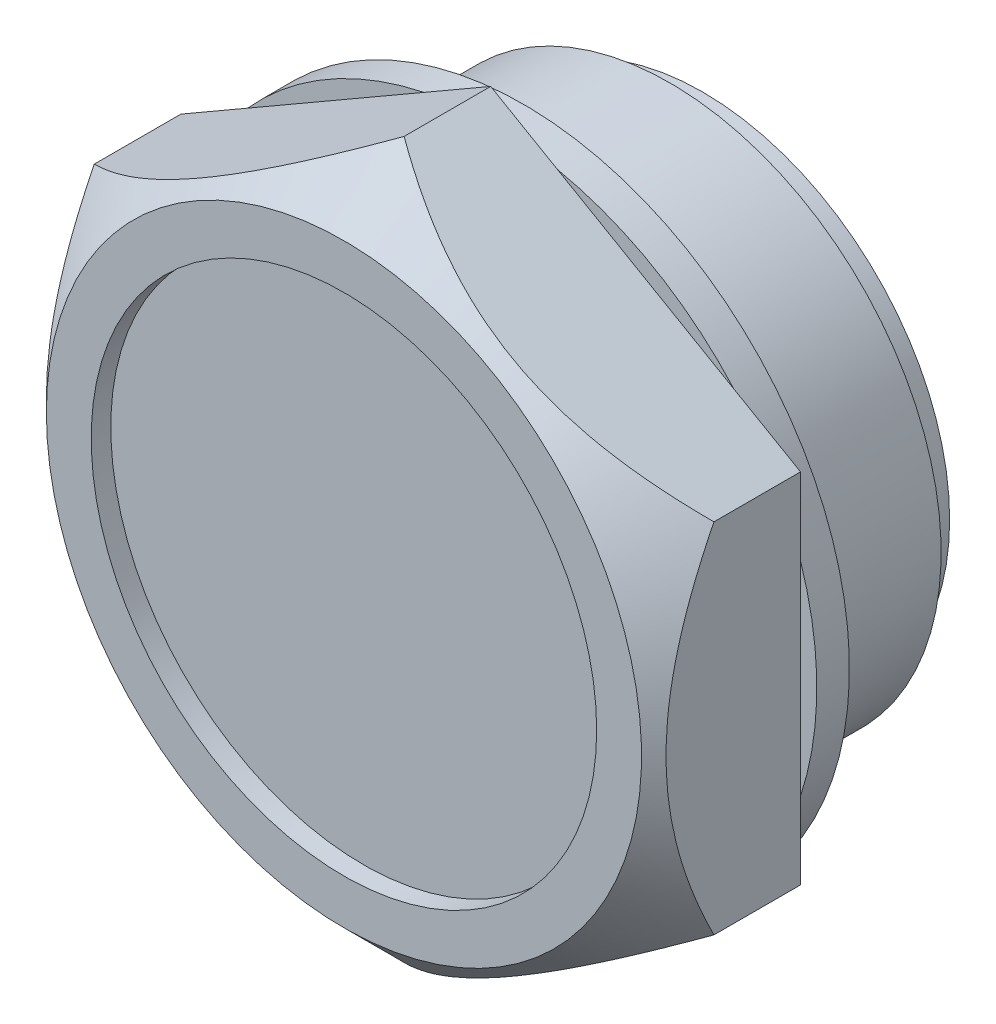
ISO-10303-21;
HEADER;
FILE_DESCRIPTION(('STEP AP214'),'2;1');
FILE_NAME('part.step','',(''),(''),'','','');
FILE_SCHEMA(('AUTOMOTIVE_DESIGN { 1 0 10303 214 1 1 1 1 }'));
ENDSEC;
DATA;
#1=APPLICATION_CONTEXT('core data for automotive mechanical design processes');
#2=APPLICATION_PROTOCOL_DEFINITION('international standard','automotive_design',2000,#1);
#3=PRODUCT_CONTEXT('',#1,'mechanical');
#4=PRODUCT('Part','Part','',(#3));
#5=PRODUCT_RELATED_PRODUCT_CATEGORY('part','',(#4));
#6=PRODUCT_DEFINITION_FORMATION('','',#4);
#7=PRODUCT_DEFINITION_CONTEXT('part definition',#1,'design');
#8=PRODUCT_DEFINITION('design','',#6,#7);
#9=PRODUCT_DEFINITION_SHAPE('','',#8);
#10=(LENGTH_UNIT() NAMED_UNIT(*) SI_UNIT(.MILLI.,.METRE.));
#11=(NAMED_UNIT(*) PLANE_ANGLE_UNIT() SI_UNIT($,.RADIAN.));
#12=(NAMED_UNIT(*) SI_UNIT($,.STERADIAN.) SOLID_ANGLE_UNIT());
#13=UNCERTAINTY_MEASURE_WITH_UNIT(LENGTH_MEASURE(1.E-05),#10,'distance_accuracy_value','');
#14=(GEOMETRIC_REPRESENTATION_CONTEXT(3) GLOBAL_UNCERTAINTY_ASSIGNED_CONTEXT((#13)) GLOBAL_UNIT_ASSIGNED_CONTEXT((#10,
#11,#12)) REPRESENTATION_CONTEXT('',''));
#15=CARTESIAN_POINT('',(0.,0.,0.));
#16=DIRECTION('',(0.,0.,1.));
#17=DIRECTION('',(1.,0.,0.));
#18=AXIS2_PLACEMENT_3D('',#15,#16,#17);
#19=CARTESIAN_POINT('',(0.,20.,2.));
#20=DIRECTION('',(0.,0.,-1.));
#21=DIRECTION('',(-1.,0.,0.));
#22=AXIS2_PLACEMENT_3D('',#19,#20,#21);
#23=PLANE('',#22);
#24=DIRECTION('',(-0.866025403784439,-0.5,0.));
#25=VECTOR('',#24,1.);
#26=CARTESIAN_POINT('',(19.0000000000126,-10.9696551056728,2.));
#27=LINE('',#26,#25);
#28=CARTESIAN_POINT('',(4.09167306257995,-19.5769816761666,2.));
#29=VERTEX_POINT('',#28);
#30=CARTESIAN_POINT('',(1.54832674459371E-08,-21.9393102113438,2.));
#31=VERTEX_POINT('',#30);
#32=EDGE_CURVE('E114',#29,#31,#27,.T.);
#33=ORIENTED_EDGE('',*,*,#32,.T.);
#34=DIRECTION('',(-0.866025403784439,0.5,0.));
#35=VECTOR('',#34,1.);
#36=CARTESIAN_POINT('',(1.54832674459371E-08,-21.9393102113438,2.));
#37=LINE('',#36,#35);
#38=CARTESIAN_POINT('',(-4.0916730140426,-19.576981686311,2.));
#39=VERTEX_POINT('',#38);
#40=EDGE_CURVE('E125',#31,#39,#37,.T.);
#41=ORIENTED_EDGE('',*,*,#40,.T.);
#42=CARTESIAN_POINT('',(0.,0.,2.));
#43=DIRECTION('',(0.,0.,-1.));
#44=DIRECTION('',(-1.,0.,0.));
#45=AXIS2_PLACEMENT_3D('',#42,#43,#44);
#46=CIRCLE('',#45,20.);
#47=EDGE_CURVE('E136',#29,#39,#46,.T.);
#48=ORIENTED_EDGE('',*,*,#47,.F.);
#49=EDGE_LOOP('',(#33,#41,#48));
#50=FACE_BOUND('',#49,.T.);
#51=ADVANCED_FACE('F15',(#50),#23,.T.);
#52=CARTESIAN_POINT('',(-14.9083269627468,-13.3319836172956,2.));
#53=VERTEX_POINT('',#52);
#54=CARTESIAN_POINT('',(-18.9999999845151,-10.9696550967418,2.));
#55=VERTEX_POINT('',#54);
#56=EDGE_CURVE('E135',#53,#55,#37,.T.);
#57=ORIENTED_EDGE('',*,*,#56,.T.);
#58=DIRECTION('',(0.,1.,0.));
#59=VECTOR('',#58,1.);
#60=CARTESIAN_POINT('',(-18.9999999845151,-10.9696550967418,2.));
#61=LINE('',#60,#59);
#62=CARTESIAN_POINT('',(-18.9999999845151,-6.24499804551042,2.));
#63=VERTEX_POINT('',#62);
#64=EDGE_CURVE('E164',#55,#63,#61,.T.);
#65=ORIENTED_EDGE('',*,*,#64,.T.);
#66=EDGE_CURVE('E209',#53,#63,#46,.T.);
#67=ORIENTED_EDGE('',*,*,#66,.F.);
#68=EDGE_LOOP('',(#57,#65,#67));
#69=FACE_BOUND('',#68,.T.);
#70=ADVANCED_FACE('F315',(#69),#23,.T.);
#71=CARTESIAN_POINT('',(-18.9999999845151,6.2449980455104,2.));
#72=VERTEX_POINT('',#71);
#73=CARTESIAN_POINT('',(-18.9999999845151,10.9696551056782,2.));
#74=VERTEX_POINT('',#73);
#75=EDGE_CURVE('E133',#72,#74,#61,.T.);
#76=ORIENTED_EDGE('',*,*,#75,.T.);
#77=DIRECTION('',(0.866025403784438,0.5,0.));
#78=VECTOR('',#77,1.);
#79=CARTESIAN_POINT('',(-18.9999999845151,10.9696551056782,2.));
#80=LINE('',#79,#78);
#81=CARTESIAN_POINT('',(-14.908326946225,13.331983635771,2.));
#82=VERTEX_POINT('',#81);
#83=EDGE_CURVE('E169',#74,#82,#80,.T.);
#84=ORIENTED_EDGE('',*,*,#83,.T.);
#85=EDGE_CURVE('E210',#72,#82,#46,.T.);
#86=ORIENTED_EDGE('',*,*,#85,.F.);
#87=EDGE_LOOP('',(#76,#84,#86));
#88=FACE_BOUND('',#87,.T.);
#89=ADVANCED_FACE('F320',(#88),#23,.T.);
#90=CARTESIAN_POINT('',(-4.09167303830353,19.5769816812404,2.));
#91=VERTEX_POINT('',#90);
#92=CARTESIAN_POINT('',(1.37390099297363E-12,21.9393102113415,2.));
#93=VERTEX_POINT('',#92);
#94=EDGE_CURVE('E167',#91,#93,#80,.T.);
#95=ORIENTED_EDGE('',*,*,#94,.T.);
#96=DIRECTION('',(0.866025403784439,-0.5,0.));
#97=VECTOR('',#96,1.);
#98=CARTESIAN_POINT('',(1.37390099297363E-12,21.9393102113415,2.));
#99=LINE('',#98,#97);
#100=CARTESIAN_POINT('',(4.09167303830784,19.5769816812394,2.));
#101=VERTEX_POINT('',#100);
#102=EDGE_CURVE('E175',#93,#101,#99,.T.);
#103=ORIENTED_EDGE('',*,*,#102,.T.);
#104=EDGE_CURVE('E215',#91,#101,#46,.T.);
#105=ORIENTED_EDGE('',*,*,#104,.F.);
#106=EDGE_LOOP('',(#95,#103,#105));
#107=FACE_BOUND('',#106,.T.);
#108=ADVANCED_FACE('F334',(#107),#23,.T.);
#109=CARTESIAN_POINT('',(19.0000000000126,-10.9696551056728,2.));
#110=VERTEX_POINT('',#109);
#111=CARTESIAN_POINT('',(14.9083269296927,-13.331983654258,2.));
#112=VERTEX_POINT('',#111);
#113=EDGE_CURVE('E142',#110,#112,#27,.T.);
#114=ORIENTED_EDGE('',*,*,#113,.T.);
#115=CARTESIAN_POINT('',(18.9999999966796,-6.24499800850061,2.));
#116=VERTEX_POINT('',#115);
#117=EDGE_CURVE('E599',#116,#112,#46,.T.);
#118=ORIENTED_EDGE('',*,*,#117,.F.);
#119=DIRECTION('',(7.05455941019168E-10,-1.,0.));
#120=VECTOR('',#119,1.);
#121=CARTESIAN_POINT('',(18.9999999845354,10.969655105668,2.));
#122=LINE('',#121,#120);
#123=EDGE_CURVE('E179',#116,#110,#122,.T.);
#124=ORIENTED_EDGE('',*,*,#123,.T.);
#125=EDGE_LOOP('',(#114,#118,#124));
#126=FACE_BOUND('',#125,.T.);
#127=ADVANCED_FACE('F325',(#126),#23,.T.);
#128=CARTESIAN_POINT('',(0.,0.,-11.));
#129=DIRECTION('',(0.,0.,-1.));
#130=DIRECTION('',(-1.,0.,0.));
#131=AXIS2_PLACEMENT_3D('',#128,#129,#130);
#132=PLANE('',#131);
#133=CARTESIAN_POINT('',(0.,0.,-11.));
#134=DIRECTION('',(0.,0.,-1.));
#135=DIRECTION('',(-1.,0.,0.));
#136=AXIS2_PLACEMENT_3D('',#133,#134,#135);
#137=CIRCLE('',#136,15.1455);
#138=CARTESIAN_POINT('',(-15.1455,0.,-11.));
#139=VERTEX_POINT('',#138);
#140=EDGE_CURVE('E231',#139,#139,#137,.T.);
#141=ORIENTED_EDGE('',*,*,#140,.T.);
#142=EDGE_LOOP('',(#141));
#143=FACE_BOUND('',#142,.T.);
#144=ADVANCED_FACE('F17',(#143),#132,.T.);
#145=CARTESIAN_POINT('',(0.,0.,-21.));
#146=DIRECTION('',(0.,0.,-1.));
#147=DIRECTION('',(-1.,0.,0.));
#148=AXIS2_PLACEMENT_3D('',#145,#146,#147);
#149=CYLINDRICAL_SURFACE('',#148,15.1455);
#150=ORIENTED_EDGE('',*,*,#140,.F.);
#151=EDGE_LOOP('',(#150));
#152=FACE_BOUND('',#151,.T.);
#153=CARTESIAN_POINT('',(0.,0.,-9.));
#154=DIRECTION('',(0.,0.,-1.));
#155=DIRECTION('',(-1.,0.,0.));
#156=AXIS2_PLACEMENT_3D('',#153,#154,#155);
#157=CIRCLE('',#156,15.1455);
#158=CARTESIAN_POINT('',(-15.1455,0.,-9.));
#159=VERTEX_POINT('',#158);
#160=EDGE_CURVE('E227',#159,#159,#157,.T.);
#161=ORIENTED_EDGE('',*,*,#160,.T.);
#162=EDGE_LOOP('',(#161));
#163=FACE_BOUND('',#162,.T.);
#164=ADVANCED_FACE('F340',(#152,#163),#149,.T.);
#165=CARTESIAN_POINT('',(0.,15.1455,-9.));
#166=DIRECTION('',(0.,0.,-1.));
#167=DIRECTION('',(-1.,0.,0.));
#168=AXIS2_PLACEMENT_3D('',#165,#166,#167);
#169=PLANE('',#168);
#170=CARTESIAN_POINT('',(0.,0.,-9.));
#171=DIRECTION('',(0.,0.,-1.));
#172=DIRECTION('',(-1.,0.,0.));
#173=AXIS2_PLACEMENT_3D('',#170,#171,#172);
#174=CIRCLE('',#173,16.6245);
#175=CARTESIAN_POINT('',(-16.6245,0.,-9.));
#176=VERTEX_POINT('',#175);
#177=EDGE_CURVE('E223',#176,#176,#174,.T.);
#178=ORIENTED_EDGE('',*,*,#177,.T.);
#179=EDGE_LOOP('',(#178));
#180=FACE_BOUND('',#179,.T.);
#181=ORIENTED_EDGE('',*,*,#160,.F.);
#182=EDGE_LOOP('',(#181));
#183=FACE_BOUND('',#182,.T.);
#184=ADVANCED_FACE('F537',(#180,#183),#169,.T.);
#185=CARTESIAN_POINT('',(0.,0.,-21.));
#186=DIRECTION('',(0.,0.,-1.));
#187=DIRECTION('',(-1.,0.,0.));
#188=AXIS2_PLACEMENT_3D('',#185,#186,#187);
#189=CYLINDRICAL_SURFACE('',#188,16.6245);
#190=ORIENTED_EDGE('',*,*,#177,.F.);
#191=EDGE_LOOP('',(#190));
#192=FACE_BOUND('',#191,.T.);
#193=CARTESIAN_POINT('',(0.,0.,0.));
#194=DIRECTION('',(0.,0.,-1.));
#195=DIRECTION('',(-1.,0.,0.));
#196=AXIS2_PLACEMENT_3D('',#193,#194,#195);
#197=CIRCLE('',#196,16.6245);
#198=CARTESIAN_POINT('',(-16.6245,0.,0.));
#199=VERTEX_POINT('',#198);
#200=EDGE_CURVE('E219',#199,#199,#197,.T.);
#201=ORIENTED_EDGE('',*,*,#200,.T.);
#202=EDGE_LOOP('',(#201));
#203=FACE_BOUND('',#202,.T.);
#204=ADVANCED_FACE('F529',(#192,#203),#189,.T.);
#205=CARTESIAN_POINT('',(0.,16.6245,0.));
#206=DIRECTION('',(0.,0.,-1.));
#207=DIRECTION('',(-1.,0.,0.));
#208=AXIS2_PLACEMENT_3D('',#205,#206,#207);
#209=PLANE('',#208);
#210=CARTESIAN_POINT('',(0.,0.,0.));
#211=DIRECTION('',(0.,0.,-1.));
#212=DIRECTION('',(-1.,0.,0.));
#213=AXIS2_PLACEMENT_3D('',#210,#211,#212);
#214=CIRCLE('',#213,20.);
#215=CARTESIAN_POINT('',(-20.,0.,0.));
#216=VERTEX_POINT('',#215);
#217=EDGE_CURVE('E214',#216,#216,#214,.T.);
#218=ORIENTED_EDGE('',*,*,#217,.T.);
#219=EDGE_LOOP('',(#218));
#220=FACE_BOUND('',#219,.T.);
#221=ORIENTED_EDGE('',*,*,#200,.F.);
#222=EDGE_LOOP('',(#221));
#223=FACE_BOUND('',#222,.T.);
#224=ADVANCED_FACE('F330',(#220,#223),#209,.T.);
#225=CARTESIAN_POINT('',(0.,0.,-21.));
#226=DIRECTION('',(0.,0.,-1.));
#227=DIRECTION('',(-1.,0.,0.));
#228=AXIS2_PLACEMENT_3D('',#225,#226,#227);
#229=CYLINDRICAL_SURFACE('',#228,20.);
#230=ORIENTED_EDGE('',*,*,#85,.T.);
#231=CARTESIAN_POINT('',(0.,0.,2.));
#232=DIRECTION('',(0.,0.,-1.));
#233=DIRECTION('',(-1.,0.,0.));
#234=AXIS2_PLACEMENT_3D('',#231,#232,#233);
#235=CIRCLE('',#234,20.);
#236=EDGE_CURVE('E203',#91,#82,#235,.F.);
#237=ORIENTED_EDGE('',*,*,#236,.F.);
#238=ORIENTED_EDGE('',*,*,#104,.T.);
#239=CARTESIAN_POINT('',(14.908326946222,13.3319836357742,2.));
#240=VERTEX_POINT('',#239);
#241=EDGE_CURVE('E378',#240,#101,#235,.F.);
#242=ORIENTED_EDGE('',*,*,#241,.F.);
#243=CARTESIAN_POINT('',(18.9999999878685,6.24499803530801,2.));
#244=VERTEX_POINT('',#243);
#245=EDGE_CURVE('E395',#240,#244,#46,.T.);
#246=ORIENTED_EDGE('',*,*,#245,.T.);
#247=EDGE_CURVE('E375',#116,#244,#235,.F.);
#248=ORIENTED_EDGE('',*,*,#247,.F.);
#249=ORIENTED_EDGE('',*,*,#117,.T.);
#250=EDGE_CURVE('E373',#29,#112,#235,.F.);
#251=ORIENTED_EDGE('',*,*,#250,.F.);
#252=ORIENTED_EDGE('',*,*,#47,.T.);
#253=EDGE_CURVE('E204',#53,#39,#235,.F.);
#254=ORIENTED_EDGE('',*,*,#253,.F.);
#255=ORIENTED_EDGE('',*,*,#66,.T.);
#256=EDGE_CURVE('E120',#72,#63,#235,.F.);
#257=ORIENTED_EDGE('',*,*,#256,.F.);
#258=EDGE_LOOP('',(#230,#237,#238,#242,#246,#248,#249,#251,#252,#254,#255,#257));
#259=FACE_BOUND('',#258,.T.);
#260=ORIENTED_EDGE('',*,*,#217,.F.);
#261=EDGE_LOOP('',(#260));
#262=FACE_BOUND('',#261,.T.);
#263=ADVANCED_FACE('F323',(#259,#262),#229,.T.);
#264=CARTESIAN_POINT('',(18.9999999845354,10.969655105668,2.));
#265=VERTEX_POINT('',#264);
#266=EDGE_CURVE('E173',#240,#265,#99,.T.);
#267=ORIENTED_EDGE('',*,*,#266,.T.);
#268=EDGE_CURVE('E181',#265,#244,#122,.T.);
#269=ORIENTED_EDGE('',*,*,#268,.T.);
#270=ORIENTED_EDGE('',*,*,#245,.F.);
#271=EDGE_LOOP('',(#267,#269,#270));
#272=FACE_BOUND('',#271,.T.);
#273=ADVANCED_FACE('F300',(#272),#23,.T.);
#274=CARTESIAN_POINT('',(-30.,-30.,2.));
#275=DIRECTION('',(0.,0.,-1.));
#276=DIRECTION('',(-1.,0.,0.));
#277=AXIS2_PLACEMENT_3D('',#274,#275,#276);
#278=PLANE('',#277);
#279=ORIENTED_EDGE('',*,*,#236,.T.);
#280=EDGE_CURVE('E174',#82,#91,#80,.T.);
#281=ORIENTED_EDGE('',*,*,#280,.T.);
#282=EDGE_LOOP('',(#279,#281));
#283=FACE_BOUND('',#282,.T.);
#284=ADVANCED_FACE('F297',(#283),#278,.F.);
#285=ORIENTED_EDGE('',*,*,#241,.T.);
#286=EDGE_CURVE('E180',#101,#240,#99,.T.);
#287=ORIENTED_EDGE('',*,*,#286,.T.);
#288=EDGE_LOOP('',(#285,#287));
#289=FACE_BOUND('',#288,.T.);
#290=ADVANCED_FACE('F299',(#289),#278,.F.);
#291=ORIENTED_EDGE('',*,*,#247,.T.);
#292=EDGE_CURVE('E37',#244,#116,#122,.T.);
#293=ORIENTED_EDGE('',*,*,#292,.T.);
#294=EDGE_LOOP('',(#291,#293));
#295=FACE_BOUND('',#294,.T.);
#296=ADVANCED_FACE('F397',(#295),#278,.F.);
#297=ORIENTED_EDGE('',*,*,#250,.T.);
#298=EDGE_CURVE('E139',#112,#29,#27,.T.);
#299=ORIENTED_EDGE('',*,*,#298,.T.);
#300=EDGE_LOOP('',(#297,#299));
#301=FACE_BOUND('',#300,.T.);
#302=ADVANCED_FACE('F402',(#301),#278,.F.);
#303=ORIENTED_EDGE('',*,*,#253,.T.);
#304=EDGE_CURVE('E128',#39,#53,#37,.T.);
#305=ORIENTED_EDGE('',*,*,#304,.T.);
#306=EDGE_LOOP('',(#303,#305));
#307=FACE_BOUND('',#306,.T.);
#308=ADVANCED_FACE('F407',(#307),#278,.F.);
#309=ORIENTED_EDGE('',*,*,#256,.T.);
#310=EDGE_CURVE('E168',#63,#72,#61,.T.);
#311=ORIENTED_EDGE('',*,*,#310,.T.);
#312=EDGE_LOOP('',(#309,#311));
#313=FACE_BOUND('',#312,.T.);
#314=ADVANCED_FACE('F302',(#313),#278,.F.);
#315=CARTESIAN_POINT('',(19.0000000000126,-10.9696551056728,2.));
#316=DIRECTION('',(-0.5,0.866025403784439,0.));
#317=DIRECTION('',(0.866025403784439,0.5,0.));
#318=AXIS2_PLACEMENT_3D('',#315,#316,#317);
#319=PLANE('',#318);
#320=DIRECTION('',(0.,0.,1.));
#321=VECTOR('',#320,1.);
#322=CARTESIAN_POINT('',(1.54832674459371E-08,-21.9393102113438,2.));
#323=LINE('',#322,#321);
#324=CARTESIAN_POINT('',(1.54832674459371E-08,-21.9393102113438,7.31068977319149));
#325=VERTEX_POINT('',#324);
#326=EDGE_CURVE('E109',#31,#325,#323,.T.);
#327=ORIENTED_EDGE('',*,*,#326,.F.);
#328=ORIENTED_EDGE('',*,*,#32,.F.);
#329=ORIENTED_EDGE('',*,*,#298,.F.);
#330=ORIENTED_EDGE('',*,*,#113,.F.);
#331=DIRECTION('',(0.,0.,1.));
#332=VECTOR('',#331,1.);
#333=CARTESIAN_POINT('',(19.0000000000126,-10.9696551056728,2.));
#334=LINE('',#333,#332);
#335=CARTESIAN_POINT('',(19.0000000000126,-10.9696551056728,7.3106897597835));
#336=VERTEX_POINT('',#335);
#337=EDGE_CURVE('E185',#110,#336,#334,.T.);
#338=ORIENTED_EDGE('',*,*,#337,.T.);
#339=CARTESIAN_POINT('',(-0.000199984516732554,-21.9394256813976,7.31057430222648));
#340=CARTESIAN_POINT('',(0.326448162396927,-21.7508352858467,7.4991351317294));
#341=CARTESIAN_POINT('',(0.655654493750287,-21.5607679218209,7.68194200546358));
#342=CARTESIAN_POINT('',(1.31958163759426,-21.1774494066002,8.03422015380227));
#343=CARTESIAN_POINT('',(1.65430534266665,-20.9841965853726,8.2036841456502));
#344=CARTESIAN_POINT('',(2.33124402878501,-20.5933658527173,8.52816648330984));
#345=CARTESIAN_POINT('',(2.67349092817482,-20.3957695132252,8.68309656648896));
#346=CARTESIAN_POINT('',(3.36360611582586,-19.9973313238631,8.97514614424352));
#347=CARTESIAN_POINT('',(3.71147353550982,-19.7964899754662,9.11226836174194));
#348=CARTESIAN_POINT('',(4.40723537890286,-19.3947916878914,9.36436398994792));
#349=CARTESIAN_POINT('',(4.75504431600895,-19.1939841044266,9.47965022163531));
#350=CARTESIAN_POINT('',(5.45554162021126,-18.7895517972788,9.68836448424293));
#351=CARTESIAN_POINT('',(5.80822946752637,-18.5859273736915,9.78179482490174));
#352=CARTESIAN_POINT('',(6.51695983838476,-18.1767417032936,9.94444948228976));
#353=CARTESIAN_POINT('',(6.87299292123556,-17.9711859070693,10.0137283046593));
#354=CARTESIAN_POINT('',(7.5880927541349,-17.5583228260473,10.1265403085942));
#355=CARTESIAN_POINT('',(7.94715904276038,-17.3510158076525,10.1700773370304));
#356=CARTESIAN_POINT('',(8.56458968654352,-16.9945420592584,10.2216376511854));
#357=CARTESIAN_POINT('',(8.82255417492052,-16.8456061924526,10.2362393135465));
#358=CARTESIAN_POINT('',(9.3387879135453,-16.5475585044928,10.2514232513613));
#359=CARTESIAN_POINT('',(9.59705714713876,-16.3984466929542,10.2520062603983));
#360=CARTESIAN_POINT('',(10.1134238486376,-16.1003222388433,10.2391389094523));
#361=CARTESIAN_POINT('',(10.3715212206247,-15.9513096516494,10.2256834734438));
#362=CARTESIAN_POINT('',(10.8868961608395,-15.6537577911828,10.1849400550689));
#363=CARTESIAN_POINT('',(11.1441737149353,-15.5052185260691,10.1576518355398));
#364=CARTESIAN_POINT('',(11.6576545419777,-15.2087602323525,10.0896114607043));
#365=CARTESIAN_POINT('',(11.9138564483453,-15.0608419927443,10.048845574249));
#366=CARTESIAN_POINT('',(12.4244831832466,-14.7660315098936,9.95443818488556));
#367=CARTESIAN_POINT('',(12.6789078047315,-14.6191393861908,9.90079520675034));
#368=CARTESIAN_POINT('',(13.438826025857,-14.1804003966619,9.72160211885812));
#369=CARTESIAN_POINT('',(13.9411555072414,-13.8903803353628,9.57776158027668));
#370=CARTESIAN_POINT('',(14.8327595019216,-13.3756125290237,9.28185516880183));
#371=CARTESIAN_POINT('',(15.2240256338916,-13.149714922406,9.13757396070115));
#372=CARTESIAN_POINT('',(15.9995498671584,-12.7019657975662,8.82576281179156));
#373=CARTESIAN_POINT('',(16.3838077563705,-12.4801144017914,8.6582321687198));
#374=CARTESIAN_POINT('',(17.1440862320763,-12.0411674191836,8.30367760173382));
#375=CARTESIAN_POINT('',(17.5201284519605,-11.8240593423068,8.11671498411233));
#376=CARTESIAN_POINT('',(18.2652503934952,-11.3938629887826,7.72575041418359));
#377=CARTESIAN_POINT('',(18.6343342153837,-11.1807723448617,7.52175890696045));
#378=CARTESIAN_POINT('',(19.0002000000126,-10.969539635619,7.31057428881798));
#379=B_SPLINE_CURVE_WITH_KNOTS('',3,(#339,#340,#341,#342,#343,#344,#345,#346,#347,#348,#349,
#350,#351,#352,#353,#354,#355,#356,#357,#358,#359,#360,#361,#362,#363,#364,#365,#366,#367,#368,
#369,#370,#371,#372,#373,#374,#375,#376,#377,#378),.UNSPECIFIED.,.F.,.F.,(4,2,2,2,2,2,2,2,2,2,2,
2,2,2,2,2,2,2,2,4),(0.,1.26511678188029,2.53091936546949,3.8039692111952,5.07682417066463,
6.32977488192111,7.58259312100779,8.83256538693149,10.0823508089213,10.9767333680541,
11.8710691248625,12.7657283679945,13.660402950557,14.5559918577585,15.4516834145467,
17.2424005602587,18.6645955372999,20.0868334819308,21.5047132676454,22.9217296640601),.UNSPECIFIED.);
#380=EDGE_CURVE('E9',#325,#336,#379,.T.);
#381=ORIENTED_EDGE('',*,*,#380,.F.);
#382=EDGE_LOOP('',(#327,#328,#329,#330,#338,#381));
#383=FACE_BOUND('',#382,.T.);
#384=ADVANCED_FACE('F111',(#383),#319,.F.);
#385=CARTESIAN_POINT('',(1.54832674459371E-08,-21.9393102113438,2.));
#386=DIRECTION('',(0.5,0.866025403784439,0.));
#387=DIRECTION('',(0.866025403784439,-0.5,0.));
#388=AXIS2_PLACEMENT_3D('',#385,#386,#387);
#389=PLANE('',#388);
#390=DIRECTION('',(0.,0.,1.));
#391=VECTOR('',#390,1.);
#392=CARTESIAN_POINT('',(-18.9999999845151,-10.9696550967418,2.));
#393=LINE('',#392,#391);
#394=CARTESIAN_POINT('',(-18.9999999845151,-10.9696550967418,7.31068977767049));
#395=VERTEX_POINT('',#394);
#396=EDGE_CURVE('E121',#55,#395,#393,.T.);
#397=ORIENTED_EDGE('',*,*,#396,.F.);
#398=ORIENTED_EDGE('',*,*,#56,.F.);
#399=ORIENTED_EDGE('',*,*,#304,.F.);
#400=ORIENTED_EDGE('',*,*,#40,.F.);
#401=ORIENTED_EDGE('',*,*,#326,.T.);
#402=CARTESIAN_POINT('',(-19.0001999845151,-10.969539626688,7.31057430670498));
#403=CARTESIAN_POINT('',(-18.6735518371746,-11.1581300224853,7.49913513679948));
#404=CARTESIAN_POINT('',(-18.3443455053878,-11.3481973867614,7.68194201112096));
#405=CARTESIAN_POINT('',(-17.6804183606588,-11.731515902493,8.03422016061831));
#406=CARTESIAN_POINT('',(-17.3456946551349,-11.9247687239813,8.20368415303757));
#407=CARTESIAN_POINT('',(-16.6687559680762,-12.3155994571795,8.52816649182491));
#408=CARTESIAN_POINT('',(-16.3265090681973,-12.513195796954,8.68309657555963));
#409=CARTESIAN_POINT('',(-15.6363938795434,-12.9116339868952,8.97514615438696));
#410=CARTESIAN_POINT('',(-15.2885264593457,-13.1124753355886,9.11226837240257));
#411=CARTESIAN_POINT('',(-14.5927646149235,-13.5141736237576,9.36436400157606));
#412=CARTESIAN_POINT('',(-14.2449556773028,-13.7149812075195,9.47965023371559));
#413=CARTESIAN_POINT('',(-13.5444583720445,-14.119413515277,9.68836449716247));
#414=CARTESIAN_POINT('',(-13.191770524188,-14.3230379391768,9.7817948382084));
#415=CARTESIAN_POINT('',(-12.4830401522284,-14.7322236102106,9.94444949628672));
#416=CARTESIAN_POINT('',(-12.127007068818,-14.937779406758,10.01372831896));
#417=CARTESIAN_POINT('',(-11.4119072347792,-15.3506424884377,10.1265403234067));
#418=CARTESIAN_POINT('',(-11.052840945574,-15.5579495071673,10.1700773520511));
#419=CARTESIAN_POINT('',(-10.4354103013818,-15.9144232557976,10.2216376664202));
#420=CARTESIAN_POINT('',(-10.1774458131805,-16.063359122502,10.2362393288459));
#421=CARTESIAN_POINT('',(-9.66121207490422,-16.3614068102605,10.251423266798));
#422=CARTESIAN_POINT('',(-9.40294284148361,-16.5105186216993,10.2520062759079));
#423=CARTESIAN_POINT('',(-8.88657614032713,-16.8086430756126,10.2391389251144));
#424=CARTESIAN_POINT('',(-8.62847876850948,-16.9576556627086,10.2256834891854));
#425=CARTESIAN_POINT('',(-8.11310382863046,-17.2552075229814,10.1849400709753));
#426=CARTESIAN_POINT('',(-7.85582627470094,-17.403746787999,10.1576518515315));
#427=CARTESIAN_POINT('',(-7.34234544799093,-17.7002050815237,10.0896114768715));
#428=CARTESIAN_POINT('',(-7.08614354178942,-17.8481233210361,10.0488455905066));
#429=CARTESIAN_POINT('',(-6.57551680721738,-18.1429338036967,9.95443820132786));
#430=CARTESIAN_POINT('',(-6.32109218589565,-18.2898259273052,9.90079522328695));
#431=CARTESIAN_POINT('',(-5.5611739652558,-18.7285649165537,9.72160213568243));
#432=CARTESIAN_POINT('',(-5.05884448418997,-19.0185849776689,9.57776159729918));
#433=CARTESIAN_POINT('',(-4.1672404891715,-19.5333527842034,9.28185518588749));
#434=CARTESIAN_POINT('',(-3.77597435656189,-19.7592503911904,9.13757397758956));
#435=CARTESIAN_POINT('',(-3.00045012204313,-20.2069995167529,8.82576282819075));
#436=CARTESIAN_POINT('',(-2.61619223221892,-20.4288509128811,8.65823218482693));
#437=CARTESIAN_POINT('',(-1.85591375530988,-20.8677978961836,8.30367761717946));
#438=CARTESIAN_POINT('',(-1.47987153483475,-21.0849059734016,8.11671499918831));
#439=CARTESIAN_POINT('',(-0.734749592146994,-21.5151023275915,7.72575042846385));
#440=CARTESIAN_POINT('',(-0.36566576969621,-21.728192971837,7.52175892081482));
#441=CARTESIAN_POINT('',(0.000200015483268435,-21.9394256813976,7.31057430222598));
#442=B_SPLINE_CURVE_WITH_KNOTS('',3,(#402,#403,#404,#405,#406,#407,#408,#409,#410,#411,#412,
#413,#414,#415,#416,#417,#418,#419,#420,#421,#422,#423,#424,#425,#426,#427,#428,#429,#430,#431,
#432,#433,#434,#435,#436,#437,#438,#439,#440,#441),.UNSPECIFIED.,.F.,.F.,(4,2,2,2,2,2,2,2,2,2,2,
2,2,2,2,2,2,2,2,4),(0.,1.26511678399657,2.53091936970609,3.80396921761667,5.0768241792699,
6.32977489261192,7.58259313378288,8.83256540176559,10.0823508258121,10.976733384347,
11.8710691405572,12.765728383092,13.6604029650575,14.555991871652,15.4516834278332,
17.2424005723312,18.6645955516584,20.0868334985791,21.5047132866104,22.9217296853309),.UNSPECIFIED.);
#443=EDGE_CURVE('E30',#395,#325,#442,.T.);
#444=ORIENTED_EDGE('',*,*,#443,.F.);
#445=EDGE_LOOP('',(#397,#398,#399,#400,#401,#444));
#446=FACE_BOUND('',#445,.T.);
#447=ADVANCED_FACE('F126',(#446),#389,.F.);
#448=CARTESIAN_POINT('',(-18.9999999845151,-10.9696550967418,2.));
#449=DIRECTION('',(1.,0.,0.));
#450=DIRECTION('',(0.,0.,-1.));
#451=AXIS2_PLACEMENT_3D('',#448,#449,#450);
#452=PLANE('',#451);
#453=DIRECTION('',(0.,0.,1.));
#454=VECTOR('',#453,1.);
#455=CARTESIAN_POINT('',(-18.9999999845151,10.9696551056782,2.));
#456=LINE('',#455,#454);
#457=CARTESIAN_POINT('',(-18.9999999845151,10.9696551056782,7.31068977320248));
#458=VERTEX_POINT('',#457);
#459=EDGE_CURVE('E194',#74,#458,#456,.T.);
#460=ORIENTED_EDGE('',*,*,#459,.F.);
#461=ORIENTED_EDGE('',*,*,#75,.F.);
#462=ORIENTED_EDGE('',*,*,#310,.F.);
#463=ORIENTED_EDGE('',*,*,#64,.F.);
#464=ORIENTED_EDGE('',*,*,#396,.T.);
#465=CARTESIAN_POINT('',(-18.9999999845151,-22.5911293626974,-0.268792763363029));
#466=CARTESIAN_POINT('',(-18.9999999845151,-22.3176575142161,-0.0595046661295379));
#467=CARTESIAN_POINT('',(-18.9999999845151,-22.0434298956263,0.148795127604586));
#468=CARTESIAN_POINT('',(-18.9999999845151,-21.4933367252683,0.563229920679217));
#469=CARTESIAN_POINT('',(-18.9999999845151,-21.2174711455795,0.769364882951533));
#470=CARTESIAN_POINT('',(-18.9999999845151,-20.3871177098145,1.38432154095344));
#471=CARTESIAN_POINT('',(-18.9999999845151,-19.8299958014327,1.78960089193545));
#472=CARTESIAN_POINT('',(-18.9999999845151,-18.7032990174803,2.59187362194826));
#473=CARTESIAN_POINT('',(-18.9999999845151,-18.1336611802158,2.98877877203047));
#474=CARTESIAN_POINT('',(-18.9999999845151,-16.9848484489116,3.76849498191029));
#475=CARTESIAN_POINT('',(-18.9999999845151,-16.4056742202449,4.15130701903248));
#476=CARTESIAN_POINT('',(-18.9999999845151,-15.2002239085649,4.92266731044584));
#477=CARTESIAN_POINT('',(-18.9999999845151,-14.5732425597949,5.31011888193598));
#478=CARTESIAN_POINT('',(-18.9999999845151,-13.3045770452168,6.0605608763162));
#479=CARTESIAN_POINT('',(-18.9999999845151,-12.6628904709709,6.42354725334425));
#480=CARTESIAN_POINT('',(-18.9999999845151,-11.3647113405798,7.11729742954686));
#481=CARTESIAN_POINT('',(-18.9999999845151,-10.7082697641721,7.44815589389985));
#482=CARTESIAN_POINT('',(-18.9999999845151,-9.37700730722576,8.07023926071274));
#483=CARTESIAN_POINT('',(-18.9999999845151,-8.70219517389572,8.361482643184));
#484=CARTESIAN_POINT('',(-18.9999999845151,-7.39691763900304,8.86894107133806));
#485=CARTESIAN_POINT('',(-18.9999999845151,-6.76820410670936,9.08962487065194));
#486=CARTESIAN_POINT('',(-18.9999999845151,-5.49489602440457,9.48064153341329));
#487=CARTESIAN_POINT('',(-18.9999999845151,-4.85030044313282,9.65097111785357));
#488=CARTESIAN_POINT('',(-18.9999999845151,-3.87993769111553,9.86040507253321));
#489=CARTESIAN_POINT('',(-18.9999999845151,-3.55897001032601,9.92216382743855));
#490=CARTESIAN_POINT('',(-18.9999999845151,-2.91448314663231,10.0303901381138));
#491=CARTESIAN_POINT('',(-18.9999999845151,-2.5909643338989,10.0768598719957));
#492=CARTESIAN_POINT('',(-18.9999999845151,-1.94204349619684,10.1537246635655));
#493=CARTESIAN_POINT('',(-18.9999999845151,-1.616641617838,10.1841209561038));
#494=CARTESIAN_POINT('',(-18.9999999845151,-0.964707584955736,10.2283041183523));
#495=CARTESIAN_POINT('',(-18.9999999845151,-0.638175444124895,10.2420911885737));
#496=CARTESIAN_POINT('',(-18.9999999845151,0.0016440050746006,10.252580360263));
#497=CARTESIAN_POINT('',(-18.9999999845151,0.314920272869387,10.2499658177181));
#498=CARTESIAN_POINT('',(-18.9999999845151,0.940957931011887,10.2292868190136));
#499=CARTESIAN_POINT('',(-18.9999999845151,1.25371932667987,10.2112225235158));
#500=CARTESIAN_POINT('',(-18.9999999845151,1.87799364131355,10.1599481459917));
#501=CARTESIAN_POINT('',(-18.9999999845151,2.18950655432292,10.1267379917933));
#502=CARTESIAN_POINT('',(-18.9999999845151,2.81065765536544,10.0457047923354));
#503=CARTESIAN_POINT('',(-18.9999999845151,3.12029559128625,9.9978798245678));
#504=CARTESIAN_POINT('',(-18.9999999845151,3.74257237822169,9.88737004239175));
#505=CARTESIAN_POINT('',(-18.9999999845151,4.05516696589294,9.82443657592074));
#506=CARTESIAN_POINT('',(-18.9999999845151,4.67735208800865,9.68509165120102));
#507=CARTESIAN_POINT('',(-18.9999999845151,4.98694224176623,9.60867850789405));
#508=CARTESIAN_POINT('',(-18.9999999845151,5.91051115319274,9.36074065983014));
#509=CARTESIAN_POINT('',(-18.9999999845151,6.51951581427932,9.17047584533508));
#510=CARTESIAN_POINT('',(-18.9999999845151,7.76334392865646,8.733975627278));
#511=CARTESIAN_POINT('',(-18.9999999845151,8.39712588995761,8.48482402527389));
#512=CARTESIAN_POINT('',(-18.9999999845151,9.6483747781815,7.94808557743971));
#513=CARTESIAN_POINT('',(-18.9999999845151,10.2658341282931,7.66048124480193));
#514=CARTESIAN_POINT('',(-18.9999999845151,11.4873446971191,7.05366731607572));
#515=CARTESIAN_POINT('',(-18.9999999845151,12.0913468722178,6.73435984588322));
#516=CARTESIAN_POINT('',(-18.9999999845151,13.2854976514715,6.07117398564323));
#517=CARTESIAN_POINT('',(-18.9999999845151,13.8756483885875,5.72729941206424));
#518=CARTESIAN_POINT('',(-18.9999999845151,15.0150182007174,5.03728315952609));
#519=CARTESIAN_POINT('',(-18.9999999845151,15.5648179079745,4.69209517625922));
#520=CARTESIAN_POINT('',(-18.9999999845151,16.6549738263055,3.98707604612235));
#521=CARTESIAN_POINT('',(-18.9999999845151,17.1953293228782,3.62724379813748));
#522=CARTESIAN_POINT('',(-18.9999999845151,18.2634741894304,2.898467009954));
#523=CARTESIAN_POINT('',(-18.9999999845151,18.7913297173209,2.52961920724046));
#524=CARTESIAN_POINT('',(-18.9999999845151,19.5777360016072,1.96898030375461));
#525=CARTESIAN_POINT('',(-18.9999999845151,19.838942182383,1.78089734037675));
#526=CARTESIAN_POINT('',(-18.9999999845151,20.3596980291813,1.40246252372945));
#527=CARTESIAN_POINT('',(-18.9999999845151,20.6192477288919,1.21211071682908));
#528=CARTESIAN_POINT('',(-18.9999999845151,20.878030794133,1.02072140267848));
#529=B_SPLINE_CURVE_WITH_KNOTS('',3,(#465,#466,#467,#468,#469,#470,#471,#472,#473,#474,#475,
#476,#477,#478,#479,#480,#481,#482,#483,#484,#485,#486,#487,#488,#489,#490,#491,#492,#493,#494,
#495,#496,#497,#498,#499,#500,#501,#502,#503,#504,#505,#506,#507,#508,#509,#510,#511,#512,#513,
#514,#515,#516,#517,#518,#519,#520,#521,#522,#523,#524,#525,#526,#527,#528),.UNSPECIFIED.,.F.,
.F.,(4,2,2,2,2,2,2,2,2,2,2,2,2,2,2,2,2,2,2,2,2,2,2,2,2,2,2,2,2,2,2,4),(0.,1.03309565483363,
2.06620897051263,4.13289932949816,6.215559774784,8.2980755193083,10.5087449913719,
12.7197791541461,14.9240871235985,17.1273632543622,19.124662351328,21.1220914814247,
22.1023517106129,23.0824722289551,24.0625174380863,25.0425508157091,25.9820311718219,
26.9215017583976,27.860976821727,28.8005755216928,29.7568490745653,30.7132422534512,
32.6253370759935,34.6668192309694,36.7092329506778,38.7581605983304,40.8067706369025,
42.7540368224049,44.7014496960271,46.6331773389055,47.5987940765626,48.564391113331),.UNSPECIFIED.);
#530=EDGE_CURVE('E282',#458,#395,#529,.F.);
#531=ORIENTED_EDGE('',*,*,#530,.F.);
#532=EDGE_LOOP('',(#460,#461,#462,#463,#464,#531));
#533=FACE_BOUND('',#532,.T.);
#534=ADVANCED_FACE('F270',(#533),#452,.F.);
#535=CARTESIAN_POINT('',(-18.9999999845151,10.9696551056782,2.));
#536=DIRECTION('',(0.5,-0.866025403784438,0.));
#537=DIRECTION('',(-0.866025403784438,-0.5,0.));
#538=AXIS2_PLACEMENT_3D('',#535,#536,#537);
#539=PLANE('',#538);
#540=DIRECTION('',(0.,0.,1.));
#541=VECTOR('',#540,1.);
#542=CARTESIAN_POINT('',(1.37390099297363E-12,21.9393102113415,2.));
#543=LINE('',#542,#541);
#544=CARTESIAN_POINT('',(1.37390099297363E-12,21.9393102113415,7.31068977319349));
#545=VERTEX_POINT('',#544);
#546=EDGE_CURVE('E190',#93,#545,#543,.T.);
#547=ORIENTED_EDGE('',*,*,#546,.F.);
#548=ORIENTED_EDGE('',*,*,#94,.F.);
#549=ORIENTED_EDGE('',*,*,#280,.F.);
#550=ORIENTED_EDGE('',*,*,#83,.F.);
#551=ORIENTED_EDGE('',*,*,#459,.T.);
#552=CARTESIAN_POINT('',(0.000200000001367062,21.9394256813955,7.31057430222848));
#553=CARTESIAN_POINT('',(-0.326448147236,21.7508352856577,7.49913513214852));
#554=CARTESIAN_POINT('',(-0.655654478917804,21.5607679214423,7.68194200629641));
#555=CARTESIAN_POINT('',(-1.31958162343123,21.1774494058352,8.03422015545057));
#556=CARTESIAN_POINT('',(-1.65430532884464,20.9841965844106,8.20368414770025));
#557=CARTESIAN_POINT('',(-2.33124401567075,20.5933658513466,8.52816648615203));
#558=CARTESIAN_POINT('',(-2.67349091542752,20.3957695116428,8.68309656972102));
#559=CARTESIAN_POINT('',(-3.3636061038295,19.997331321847,8.97514614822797));
#560=CARTESIAN_POINT('',(-3.71147352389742,19.7964899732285,9.11226836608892));
#561=CARTESIAN_POINT('',(-4.40723536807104,19.394791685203,9.36436399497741));
#562=CARTESIAN_POINT('',(-4.75504430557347,19.1939841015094,9.47965022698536));
#563=CARTESIAN_POINT('',(-5.45554161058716,18.7895517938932,9.68836449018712));
#564=CARTESIAN_POINT('',(-5.8082294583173,18.5859273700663,9.78179483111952));
#565=CARTESIAN_POINT('',(-6.5169598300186,18.1767416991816,9.94444948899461));
#566=CARTESIAN_POINT('',(-6.8729929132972,17.9711859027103,10.013728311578));
#567=CARTESIAN_POINT('',(-7.58809274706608,17.5583228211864,10.1265403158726));
#568=CARTESIAN_POINT('',(-7.94715903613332,17.3510158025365,10.1700773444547));
#569=CARTESIAN_POINT('',(-8.5645896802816,16.9945420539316,10.2216376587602));
#570=CARTESIAN_POINT('',(-8.82255416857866,16.8456061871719,10.2362393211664));
#571=CARTESIAN_POINT('',(-9.33878790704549,16.5475584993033,10.2514232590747));
#572=CARTESIAN_POINT('',(-9.59705714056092,16.3984466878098,10.2520062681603));
#573=CARTESIAN_POINT('',(-10.113423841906,16.1003222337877,10.2391389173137));
#574=CARTESIAN_POINT('',(-10.3715212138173,15.9513096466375,10.225683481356));
#575=CARTESIAN_POINT('',(-10.8868961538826,15.6537577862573,10.1849400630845));
#576=CARTESIAN_POINT('',(-11.1441737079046,15.5052185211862,10.157651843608));
#577=CARTESIAN_POINT('',(-11.6576545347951,15.2087602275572,10.0896114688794));
#578=CARTESIAN_POINT('',(-11.9138564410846,15.0608419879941,10.0488455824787));
#579=CARTESIAN_POINT('',(-12.4244831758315,14.7660315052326,9.95443819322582));
#580=CARTESIAN_POINT('',(-12.67890779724,14.6191393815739,9.9007952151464));
#581=CARTESIAN_POINT('',(-13.4388260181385,14.180400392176,9.72160212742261));
#582=CARTESIAN_POINT('',(-13.9411554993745,13.8903803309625,9.57776158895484));
#583=CARTESIAN_POINT('',(-14.8327594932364,13.3756125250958,9.2818551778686));
#584=CARTESIAN_POINT('',(-15.2240256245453,13.1497149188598,9.13757397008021));
#585=CARTESIAN_POINT('',(-15.9995498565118,12.701965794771,8.82576282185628));
#586=CARTESIAN_POINT('',(-16.3838077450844,12.4801143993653,8.6582321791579));
#587=CARTESIAN_POINT('',(-17.1440862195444,12.0411674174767,8.30367761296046));
#588=CARTESIAN_POINT('',(-17.5201284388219,11.8240593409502,8.11671499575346));
#589=CARTESIAN_POINT('',(-18.2652503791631,11.3938629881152,7.7257504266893));
#590=CARTESIAN_POINT('',(-18.6343342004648,11.1807723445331,7.52175891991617));
#591=CARTESIAN_POINT('',(-19.0001999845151,10.9695396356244,7.310574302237));
#592=B_SPLINE_CURVE_WITH_KNOTS('',3,(#552,#553,#554,#555,#556,#557,#558,#559,#560,#561,#562,
#563,#564,#565,#566,#567,#568,#569,#570,#571,#572,#573,#574,#575,#576,#577,#578,#579,#580,#581,
#582,#583,#584,#585,#586,#587,#588,#589,#590,#591),.UNSPECIFIED.,.F.,.F.,(4,2,2,2,2,2,2,2,2,2,2,
2,2,2,2,2,2,2,2,4),(0.,1.26511678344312,2.53091936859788,3.80396921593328,5.07682417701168,
6.32977488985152,7.58259313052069,8.83256539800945,10.0823508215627,10.9767333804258,
11.8710691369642,12.7657283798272,13.6604029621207,14.5559918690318,15.4516834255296,
17.2424005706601,18.6645955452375,20.0868334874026,21.5047132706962,22.9217296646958),.UNSPECIFIED.);
#593=EDGE_CURVE('E274',#545,#458,#592,.T.);
#594=ORIENTED_EDGE('',*,*,#593,.F.);
#595=EDGE_LOOP('',(#547,#548,#549,#550,#551,#594));
#596=FACE_BOUND('',#595,.T.);
#597=ADVANCED_FACE('F265',(#596),#539,.F.);
#598=CARTESIAN_POINT('',(1.37390099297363E-12,21.9393102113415,2.));
#599=DIRECTION('',(-0.5,-0.866025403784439,0.));
#600=DIRECTION('',(-0.866025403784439,0.5,0.));
#601=AXIS2_PLACEMENT_3D('',#598,#599,#600);
#602=PLANE('',#601);
#603=DIRECTION('',(0.,0.,1.));
#604=VECTOR('',#603,1.);
#605=CARTESIAN_POINT('',(18.9999999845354,10.969655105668,2.));
#606=LINE('',#605,#604);
#607=CARTESIAN_POINT('',(18.9999999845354,10.9696551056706,7.3106897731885));
#608=VERTEX_POINT('',#607);
#609=EDGE_CURVE('E43',#265,#608,#606,.T.);
#610=ORIENTED_EDGE('',*,*,#609,.F.);
#611=ORIENTED_EDGE('',*,*,#266,.F.);
#612=ORIENTED_EDGE('',*,*,#286,.F.);
#613=ORIENTED_EDGE('',*,*,#102,.F.);
#614=ORIENTED_EDGE('',*,*,#546,.T.);
#615=CARTESIAN_POINT('',(19.0001999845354,10.9695396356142,7.31057430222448));
#616=CARTESIAN_POINT('',(18.6735518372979,11.158130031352,7.49913513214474));
#617=CARTESIAN_POINT('',(18.3443455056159,11.3481973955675,7.68194200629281));
#618=CARTESIAN_POINT('',(17.6804183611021,11.7315159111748,8.0342201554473));
#619=CARTESIAN_POINT('',(17.3456946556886,11.9247687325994,8.20368414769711));
#620=CARTESIAN_POINT('',(16.6687559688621,12.3155994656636,8.52816648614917));
#621=CARTESIAN_POINT('',(16.3265090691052,12.5131958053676,8.6830965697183));
#622=CARTESIAN_POINT('',(15.6363938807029,12.9116339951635,8.9751461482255));
#623=CARTESIAN_POINT('',(15.2885264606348,13.1124753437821,9.11226836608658));
#624=CARTESIAN_POINT('',(14.5927646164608,13.5141736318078,9.3643639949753));
#625=CARTESIAN_POINT('',(14.2449556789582,13.7149812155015,9.47965022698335));
#626=CARTESIAN_POINT('',(13.5444583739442,14.1194135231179,9.68836449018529));
#627=CARTESIAN_POINT('',(13.1917705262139,14.3230379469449,9.78179483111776));
#628=CARTESIAN_POINT('',(12.4830401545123,14.7322236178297,9.94444948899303));
#629=CARTESIAN_POINT('',(12.1270070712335,14.9377794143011,10.0137283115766));
#630=CARTESIAN_POINT('',(11.4119072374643,15.3506424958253,10.1265403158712));
#631=CARTESIAN_POINT('',(11.0528409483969,15.5579495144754,10.1700773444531));
#632=CARTESIAN_POINT('',(10.4354103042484,15.9144232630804,10.2216376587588));
#633=CARTESIAN_POINT('',(10.1774458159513,16.06335912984,10.236239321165));
#634=CARTESIAN_POINT('',(9.66121207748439,16.3614068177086,10.2514232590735));
#635=CARTESIAN_POINT('',(9.40294284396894,16.5105186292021,10.252006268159));
#636=CARTESIAN_POINT('',(8.88657614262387,16.8086430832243,10.2391389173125));
#637=CARTESIAN_POINT('',(8.6284787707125,16.9576556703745,10.2256834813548));
#638=CARTESIAN_POINT('',(8.11310383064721,17.2552075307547,10.1849400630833));
#639=CARTESIAN_POINT('',(7.85582627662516,17.4037467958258,10.1576518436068));
#640=CARTESIAN_POINT('',(7.3423454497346,17.7002050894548,10.0896114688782));
#641=CARTESIAN_POINT('',(7.08614354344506,17.848123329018,10.0488455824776));
#642=CARTESIAN_POINT('',(6.57551680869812,18.1429338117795,9.9544381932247));
#643=CARTESIAN_POINT('',(6.32109218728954,18.2898259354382,9.9007952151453));
#644=CARTESIAN_POINT('',(5.56117396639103,18.7285649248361,9.72160212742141));
#645=CARTESIAN_POINT('',(5.05884448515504,19.0185849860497,9.57776158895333));
#646=CARTESIAN_POINT('',(4.16724049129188,19.5333527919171,9.28185517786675));
#647=CARTESIAN_POINT('',(3.77597435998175,19.7592503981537,9.13757397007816));
#648=CARTESIAN_POINT('',(3.00045012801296,20.2069995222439,8.82576282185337));
#649=CARTESIAN_POINT('',(2.61619223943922,20.4288509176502,8.65823217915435));
#650=CARTESIAN_POINT('',(1.85591376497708,20.8677978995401,8.3036776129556));
#651=CARTESIAN_POINT('',(1.47987154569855,21.0849059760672,8.11671499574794));
#652=CARTESIAN_POINT('',(0.734749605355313,21.5151023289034,7.72575042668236));
#653=CARTESIAN_POINT('',(0.365665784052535,21.7281929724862,7.52175891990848));
#654=CARTESIAN_POINT('',(-0.000199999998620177,21.9394256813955,7.31057430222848));
#655=B_SPLINE_CURVE_WITH_KNOTS('',3,(#615,#616,#617,#618,#619,#620,#621,#622,#623,#624,#625,
#626,#627,#628,#629,#630,#631,#632,#633,#634,#635,#636,#637,#638,#639,#640,#641,#642,#643,#644,
#645,#646,#647,#648,#649,#650,#651,#652,#653,#654),.UNSPECIFIED.,.F.,.F.,(4,2,2,2,2,2,2,2,2,2,2,
2,2,2,2,2,2,2,2,4),(0.,1.26511678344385,2.53091936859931,3.80396921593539,5.07682417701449,
6.32977488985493,7.5825931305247,8.83256539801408,10.082350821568,10.9767333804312,
11.8710691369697,12.7657283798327,13.6604029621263,14.5559918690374,15.4516834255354,
17.2424005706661,18.6645955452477,20.086833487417,21.5047132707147,22.9217296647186),.UNSPECIFIED.);
#656=EDGE_CURVE('E244',#608,#545,#655,.T.);
#657=ORIENTED_EDGE('',*,*,#656,.F.);
#658=EDGE_LOOP('',(#610,#611,#612,#613,#614,#657));
#659=FACE_BOUND('',#658,.T.);
#660=ADVANCED_FACE('F259',(#659),#602,.F.);
#661=CARTESIAN_POINT('',(18.9999999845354,10.969655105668,2.));
#662=DIRECTION('',(-1.,-7.05455941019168E-10,0.));
#663=DIRECTION('',(-7.05455941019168E-10,1.,0.));
#664=AXIS2_PLACEMENT_3D('',#661,#662,#663);
#665=PLANE('',#664);
#666=ORIENTED_EDGE('',*,*,#337,.F.);
#667=ORIENTED_EDGE('',*,*,#123,.F.);
#668=ORIENTED_EDGE('',*,*,#292,.F.);
#669=ORIENTED_EDGE('',*,*,#268,.F.);
#670=ORIENTED_EDGE('',*,*,#609,.T.);
#671=CARTESIAN_POINT('',(19.0000000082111,-22.5911293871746,-0.268792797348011));
#672=CARTESIAN_POINT('',(19.0000000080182,-22.3176575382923,-0.0595046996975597));
#673=CARTESIAN_POINT('',(19.0000000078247,-22.0434299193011,0.148795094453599));
#674=CARTESIAN_POINT('',(19.0000000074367,-21.4933367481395,0.563229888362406));
#675=CARTESIAN_POINT('',(19.000000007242,-21.2174711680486,0.769364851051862));
#676=CARTESIAN_POINT('',(19.0000000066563,-20.3871177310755,1.38432151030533));
#677=CARTESIAN_POINT('',(19.0000000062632,-19.8299958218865,1.78960086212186));
#678=CARTESIAN_POINT('',(19.0000000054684,-18.7032990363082,2.59187359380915));
#679=CARTESIAN_POINT('',(19.0000000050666,-18.1336611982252,2.98877874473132));
#680=CARTESIAN_POINT('',(19.0000000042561,-16.9848484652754,3.76849495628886));
#681=CARTESIAN_POINT('',(19.0000000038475,-16.4056742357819,4.1513069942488));
#682=CARTESIAN_POINT('',(19.0000000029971,-15.2002239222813,4.92266728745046));
#683=CARTESIAN_POINT('',(19.0000000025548,-14.5732425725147,5.31011885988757));
#684=CARTESIAN_POINT('',(19.0000000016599,-13.3045770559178,6.06056085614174));
#685=CARTESIAN_POINT('',(19.0000000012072,-12.6628904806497,6.42354723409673));
#686=CARTESIAN_POINT('',(19.0000000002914,-11.3647113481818,7.11729741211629));
#687=CARTESIAN_POINT('',(18.9999999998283,-10.7082697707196,7.4481558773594));
#688=CARTESIAN_POINT('',(18.9999999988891,-9.37700731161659,8.0702392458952));
#689=CARTESIAN_POINT('',(18.9999999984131,-8.70219517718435,8.36148262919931));
#690=CARTESIAN_POINT('',(18.9999999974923,-7.39691764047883,8.86894105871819));
#691=CARTESIAN_POINT('',(18.9999999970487,-6.76820410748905,9.08962485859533));
#692=CARTESIAN_POINT('',(18.9999999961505,-5.49489602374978,9.48064152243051));
#693=CARTESIAN_POINT('',(18.9999999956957,-4.85030044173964,9.65097110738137));
#694=CARTESIAN_POINT('',(18.9999999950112,-3.87993768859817,9.86040506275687));
#695=CARTESIAN_POINT('',(18.9999999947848,-3.55897000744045,9.92216381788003));
#696=CARTESIAN_POINT('',(18.9999999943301,-2.91448314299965,10.0303901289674));
#697=CARTESIAN_POINT('',(18.9999999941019,-2.59096432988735,10.0768598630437));
#698=CARTESIAN_POINT('',(18.9999999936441,-1.94204349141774,10.1537246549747));
#699=CARTESIAN_POINT('',(18.9999999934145,-1.61664161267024,10.1841209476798));
#700=CARTESIAN_POINT('',(18.9999999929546,-0.964707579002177,10.2283041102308));
#701=CARTESIAN_POINT('',(18.9999999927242,-0.638175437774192,10.242091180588));
#702=CARTESIAN_POINT('',(18.9999999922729,0.00164401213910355,10.2525803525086));
#703=CARTESIAN_POINT('',(18.9999999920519,0.314920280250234,10.2499658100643));
#704=CARTESIAN_POINT('',(18.9999999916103,0.940957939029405,10.2292868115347));
#705=CARTESIAN_POINT('',(18.9999999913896,1.25371933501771,10.2112225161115));
#706=CARTESIAN_POINT('',(18.9999999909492,1.87799365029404,10.1599481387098));
#707=CARTESIAN_POINT('',(18.9999999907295,2.18950656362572,10.1267379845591));
#708=CARTESIAN_POINT('',(18.9999999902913,2.81065766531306,10.04570478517));
#709=CARTESIAN_POINT('',(18.9999999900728,3.12029560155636,9.99787981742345));
#710=CARTESIAN_POINT('',(18.9999999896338,3.74257238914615,9.88737003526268));
#711=CARTESIAN_POINT('',(18.9999999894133,4.05516697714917,9.82443656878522));
#712=CARTESIAN_POINT('',(18.9999999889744,4.67735209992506,9.68509164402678));
#713=CARTESIAN_POINT('',(18.999999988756,4.98694225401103,9.60867850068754));
#714=CARTESIAN_POINT('',(18.9999999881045,5.91051116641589,9.36074065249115));
#715=CARTESIAN_POINT('',(18.9999999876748,6.51951582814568,9.17047583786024));
#716=CARTESIAN_POINT('',(18.9999999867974,7.76334394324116,8.73397561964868));
#717=CARTESIAN_POINT('',(18.9999999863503,8.39712590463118,8.48482401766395));
#718=CARTESIAN_POINT('',(18.9999999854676,9.64837479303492,7.94808556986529));
#719=CARTESIAN_POINT('',(18.999999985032,10.2658341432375,7.66048123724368));
#720=CARTESIAN_POINT('',(18.9999999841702,11.4873447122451,7.05366730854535));
#721=CARTESIAN_POINT('',(18.9999999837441,12.0913468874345,6.73435983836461));
#722=CARTESIAN_POINT('',(18.9999999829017,13.285497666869,6.07117397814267));
#723=CARTESIAN_POINT('',(18.9999999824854,13.8756484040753,5.72729940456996));
#724=CARTESIAN_POINT('',(18.9999999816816,15.0150182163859,5.03728315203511));
#725=CARTESIAN_POINT('',(18.9999999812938,15.5648179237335,4.69209516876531));
#726=CARTESIAN_POINT('',(18.9999999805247,16.6549738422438,3.98707603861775));
#727=CARTESIAN_POINT('',(18.9999999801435,17.1953293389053,3.6272437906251));
#728=CARTESIAN_POINT('',(18.99999997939,18.2634742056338,2.89846700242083));
#729=CARTESIAN_POINT('',(18.9999999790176,18.7913297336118,2.52961919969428));
#730=CARTESIAN_POINT('',(18.9999999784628,19.577736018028,1.96898029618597));
#731=CARTESIAN_POINT('',(18.9999999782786,19.8389421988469,1.78089733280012));
#732=CARTESIAN_POINT('',(18.9999999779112,20.3596980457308,1.40246251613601));
#733=CARTESIAN_POINT('',(18.9999999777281,20.619247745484,1.2121107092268));
#734=CARTESIAN_POINT('',(18.9999999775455,20.8780308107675,1.02072139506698));
#735=B_SPLINE_CURVE_WITH_KNOTS('',3,(#671,#672,#673,#674,#675,#676,#677,#678,#679,#680,#681,
#682,#683,#684,#685,#686,#687,#688,#689,#690,#691,#692,#693,#694,#695,#696,#697,#698,#699,#700,
#701,#702,#703,#704,#705,#706,#707,#708,#709,#710,#711,#712,#713,#714,#715,#716,#717,#718,#719,
#720,#721,#722,#723,#724,#725,#726,#727,#728,#729,#730,#731,#732,#733,#734),.UNSPECIFIED.,.F.,
.F.,(4,2,2,2,2,2,2,2,2,2,2,2,2,2,2,2,2,2,2,2,2,2,2,2,2,2,2,2,2,2,2,4),(0.,1.03309565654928,
2.06620897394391,4.13289933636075,6.21555978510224,8.29807553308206,10.5087450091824,
12.7197791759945,14.9240871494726,17.1273632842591,19.1246623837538,21.1220915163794,
22.1023517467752,23.0824722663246,24.0625174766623,25.0425508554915,25.9820312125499,
26.9215018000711,27.860976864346,28.8005755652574,29.7568491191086,30.7132422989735,
32.6253371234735,34.666819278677,36.7092329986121,38.7581606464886,40.8067706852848,
42.7540368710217,44.7014497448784,46.6331773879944,47.5987941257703,48.5643911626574),.UNSPECIFIED.);
#736=EDGE_CURVE('E235',#336,#608,#735,.T.);
#737=ORIENTED_EDGE('',*,*,#736,.F.);
#738=EDGE_LOOP('',(#666,#667,#668,#669,#670,#737));
#739=FACE_BOUND('',#738,.T.);
#740=ADVANCED_FACE('F255',(#739),#665,.F.);
#741=CARTESIAN_POINT('',(0.,0.,11.));
#742=DIRECTION('',(0.,0.,-1.));
#743=DIRECTION('',(-1.,0.,0.));
#744=AXIS2_PLACEMENT_3D('',#741,#742,#743);
#745=PLANE('',#744);
#746=CARTESIAN_POINT('',(0.,0.,11.));
#747=DIRECTION('',(0.,0.,1.));
#748=DIRECTION('',(1.,0.,0.));
#749=AXIS2_PLACEMENT_3D('',#746,#747,#748);
#750=CIRCLE('',#749,15.5);
#751=CARTESIAN_POINT('',(15.5,0.,11.));
#752=VERTEX_POINT('',#751);
#753=EDGE_CURVE('E147',#752,#752,#750,.T.);
#754=ORIENTED_EDGE('',*,*,#753,.F.);
#755=EDGE_LOOP('',(#754));
#756=FACE_BOUND('',#755,.T.);
#757=CARTESIAN_POINT('',(0.,0.,11.));
#758=DIRECTION('',(0.,0.,-1.));
#759=DIRECTION('',(-1.,0.,0.));
#760=AXIS2_PLACEMENT_3D('',#757,#758,#759);
#761=CIRCLE('',#760,18.2499999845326);
#762=CARTESIAN_POINT('',(-18.2499999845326,0.,11.));
#763=VERTEX_POINT('',#762);
#764=EDGE_CURVE('E205',#763,#763,#761,.T.);
#765=ORIENTED_EDGE('',*,*,#764,.F.);
#766=EDGE_LOOP('',(#765));
#767=FACE_BOUND('',#766,.T.);
#768=ADVANCED_FACE('F258',(#756,#767),#745,.F.);
#769=CARTESIAN_POINT('',(0.,0.,11.));
#770=DIRECTION('',(0.,0.,-1.));
#771=DIRECTION('',(-1.,0.,0.));
#772=AXIS2_PLACEMENT_3D('',#769,#770,#771);
#773=CONICAL_SURFACE('',#772,18.2499999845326,0.785398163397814);
#774=ORIENTED_EDGE('',*,*,#443,.T.);
#775=ORIENTED_EDGE('',*,*,#380,.T.);
#776=ORIENTED_EDGE('',*,*,#736,.T.);
#777=ORIENTED_EDGE('',*,*,#656,.T.);
#778=ORIENTED_EDGE('',*,*,#593,.T.);
#779=ORIENTED_EDGE('',*,*,#530,.T.);
#780=EDGE_LOOP('',(#774,#775,#776,#777,#778,#779));
#781=FACE_BOUND('',#780,.T.);
#782=ORIENTED_EDGE('',*,*,#764,.T.);
#783=EDGE_LOOP('',(#782));
#784=FACE_BOUND('',#783,.T.);
#785=ADVANCED_FACE('F251',(#781,#784),#773,.T.);
#786=CARTESIAN_POINT('',(0.,0.,9.8));
#787=DIRECTION('',(0.,0.,1.));
#788=DIRECTION('',(1.,0.,0.));
#789=AXIS2_PLACEMENT_3D('',#786,#787,#788);
#790=CYLINDRICAL_SURFACE('',#789,15.5);
#791=CARTESIAN_POINT('',(0.,0.,9.8));
#792=DIRECTION('',(0.,0.,1.));
#793=DIRECTION('',(1.,0.,0.));
#794=AXIS2_PLACEMENT_3D('',#791,#792,#793);
#795=CIRCLE('',#794,15.5);
#796=CARTESIAN_POINT('',(15.5,0.,9.8));
#797=VERTEX_POINT('',#796);
#798=EDGE_CURVE('E140',#797,#797,#795,.T.);
#799=ORIENTED_EDGE('',*,*,#798,.F.);
#800=EDGE_LOOP('',(#799));
#801=FACE_BOUND('',#800,.T.);
#802=ORIENTED_EDGE('',*,*,#753,.T.);
#803=EDGE_LOOP('',(#802));
#804=FACE_BOUND('',#803,.T.);
#805=ADVANCED_FACE('F310',(#801,#804),#790,.F.);
#806=CARTESIAN_POINT('',(0.,0.,9.8));
#807=DIRECTION('',(0.,0.,1.));
#808=DIRECTION('',(1.,0.,0.));
#809=AXIS2_PLACEMENT_3D('',#806,#807,#808);
#810=PLANE('',#809);
#811=ORIENTED_EDGE('',*,*,#798,.T.);
#812=EDGE_LOOP('',(#811));
#813=FACE_BOUND('',#812,.T.);
#814=ADVANCED_FACE('F474',(#813),#810,.T.);
#815=CLOSED_SHELL('',(#51,#70,#89,#108,#127,#144,#164,#184,#204,#224,#263,#273,#284,#290,#296,
#302,#308,#314,#384,#447,#534,#597,#660,#740,#768,#785,#805,#814));
#816=MANIFOLD_SOLID_BREP('B1',#815);
#817=ADVANCED_BREP_SHAPE_REPRESENTATION('',(#18,#816),#14);
#818=SHAPE_DEFINITION_REPRESENTATION(#9,#817);
ENDSEC;
END-ISO-10303-21;
